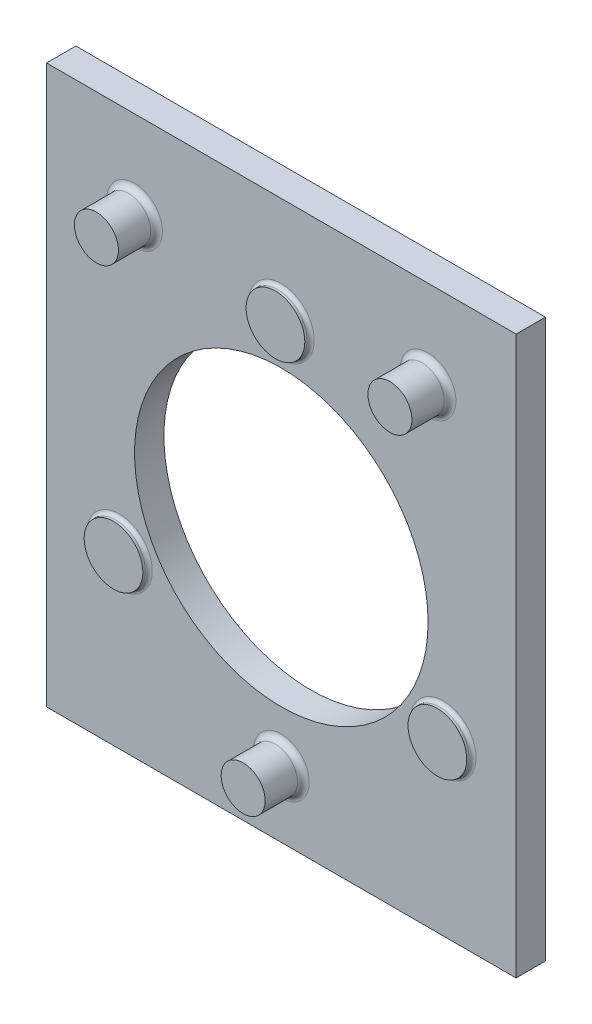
from build123d import *

# Parameters (mm, degrees)
SKETCH1_W           = 203.2
SKETCH1_H           = 241.3
SKETCH1_R           = 63.5
BASE_EXTRUDE_DEPTH  = 12.7
SKETCH3_R           = 12.7
BOSS_EXTRUDE2_DEPTH = 2.54
SKETCH4_R           = 9.525
BOSS_EXTRUDE4_DEPTH = 16.51
SKETCH5_R           = 9.525
BOSS_EXTRUDE5_DEPTH = 16.51
FILLET4_R           = 2.54
FILLET5_R           = 1.524


with BuildPart() as part:
    # Sketch1 → Base-Extrude (new body)
    with BuildSketch(Plane.XY):
        with Locations((101.6, 120.65)):
            Rectangle(SKETCH1_W, SKETCH1_H)
        with Locations((101.6, 114.3)):
            Circle(SKETCH1_R, mode=Mode.SUBTRACT)
    extrude(amount=BASE_EXTRUDE_DEPTH)

    # Sketch3 → Boss-Extrude2 (add)
    with BuildSketch(Plane.XY.offset(12.7)):
        with Locations(Location((31.527468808, 73.843605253, 0), (0, 0, 180))):
            Circle(SKETCH3_R)
        with Locations(Location((101.6, 195.212789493, 0), (0, 0, 180))):
            Circle(SKETCH3_R)
        with Locations(Location((171.672531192, 73.843605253, 0), (0, 0, 180))):
            Circle(SKETCH3_R)
    extrude(amount=BOSS_EXTRUDE2_DEPTH)

    # Sketch4 → Boss-Extrude4 (add)
    with BuildSketch(Plane.XY.offset(12.7)):
        with Locations(Location((38.1, 203.2, 0), (0, 0, 180))):
            Circle(SKETCH4_R)
        with Locations(Location((165.1, 203.2, 0), (0, 0, 180))):
            Circle(SKETCH4_R)
    extrude(amount=BOSS_EXTRUDE4_DEPTH)

    # Sketch5 → Boss-Extrude5 (add)
    with BuildSketch(Plane.XY.offset(12.7)):
        with Locations(Location((101.6, 28.575, 0), (0, 0, 180))):
            Circle(SKETCH5_R)
    extrude(amount=BOSS_EXTRUDE5_DEPTH)

    # Fillet4
    fillet4_edges = [part.edges().sort_by_distance(p)[0] for p in [
        (47.625, 203.2, 12.7),
        (174.625, 203.2, 12.7),
        (111.125, 28.575, 12.7),
    ]]
    fillet(fillet4_edges, radius=FILLET4_R)

    # Fillet5
    fillet5_edges = [part.edges().sort_by_distance(p)[0] for p in [
        (44.227468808, 73.843605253, 12.7),
        (114.3, 195.212789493, 12.7),
        (184.372531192, 73.843605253, 12.7),
    ]]
    fillet(fillet5_edges, radius=FILLET5_R)


solid = part.part
